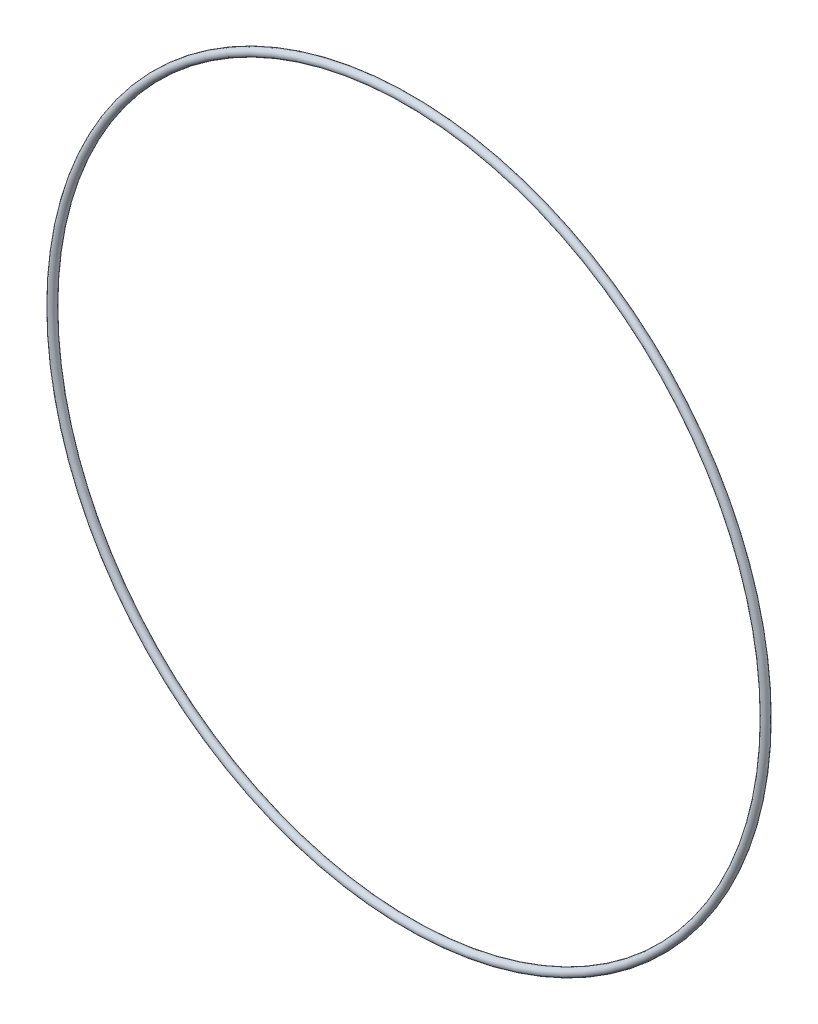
ISO-10303-21;
HEADER;
FILE_DESCRIPTION(('STEP AP214'),'2;1');
FILE_NAME('part.step','',(''),(''),'','','');
FILE_SCHEMA(('AUTOMOTIVE_DESIGN { 1 0 10303 214 1 1 1 1 }'));
ENDSEC;
DATA;
#1=APPLICATION_CONTEXT('core data for automotive mechanical design processes');
#2=APPLICATION_PROTOCOL_DEFINITION('international standard','automotive_design',2000,#1);
#3=PRODUCT_CONTEXT('',#1,'mechanical');
#4=PRODUCT('Part','Part','',(#3));
#5=PRODUCT_RELATED_PRODUCT_CATEGORY('part','',(#4));
#6=PRODUCT_DEFINITION_FORMATION('','',#4);
#7=PRODUCT_DEFINITION_CONTEXT('part definition',#1,'design');
#8=PRODUCT_DEFINITION('design','',#6,#7);
#9=PRODUCT_DEFINITION_SHAPE('','',#8);
#10=(LENGTH_UNIT() NAMED_UNIT(*) SI_UNIT(.MILLI.,.METRE.));
#11=(NAMED_UNIT(*) PLANE_ANGLE_UNIT() SI_UNIT($,.RADIAN.));
#12=(NAMED_UNIT(*) SI_UNIT($,.STERADIAN.) SOLID_ANGLE_UNIT());
#13=UNCERTAINTY_MEASURE_WITH_UNIT(LENGTH_MEASURE(1.E-05),#10,'distance_accuracy_value','');
#14=(GEOMETRIC_REPRESENTATION_CONTEXT(3) GLOBAL_UNCERTAINTY_ASSIGNED_CONTEXT((#13)) GLOBAL_UNIT_ASSIGNED_CONTEXT((#10,
#11,#12)) REPRESENTATION_CONTEXT('',''));
#15=CARTESIAN_POINT('',(0.,0.,0.));
#16=DIRECTION('',(0.,0.,1.));
#17=DIRECTION('',(1.,0.,0.));
#18=AXIS2_PLACEMENT_3D('',#15,#16,#17);
#19=CARTESIAN_POINT('',(0.,0.,0.));
#20=DIRECTION('',(0.,0.,1.));
#21=DIRECTION('',(1.,0.,0.));
#22=AXIS2_PLACEMENT_3D('',#19,#20,#21);
#23=TOROIDAL_SURFACE('',#22,243.3955,2.66699999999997);
#24=CARTESIAN_POINT('',(246.0625,0.,0.));
#25=VERTEX_POINT('',#24);
#26=VERTEX_LOOP('',#25);
#27=FACE_BOUND('',#26,.T.);
#28=ADVANCED_FACE('F28',(#27),#23,.T.);
#29=CLOSED_SHELL('',(#28));
#30=MANIFOLD_SOLID_BREP('B2',#29);
#31=ADVANCED_BREP_SHAPE_REPRESENTATION('',(#18,#30),#14);
#32=SHAPE_DEFINITION_REPRESENTATION(#9,#31);
ENDSEC;
END-ISO-10303-21;
